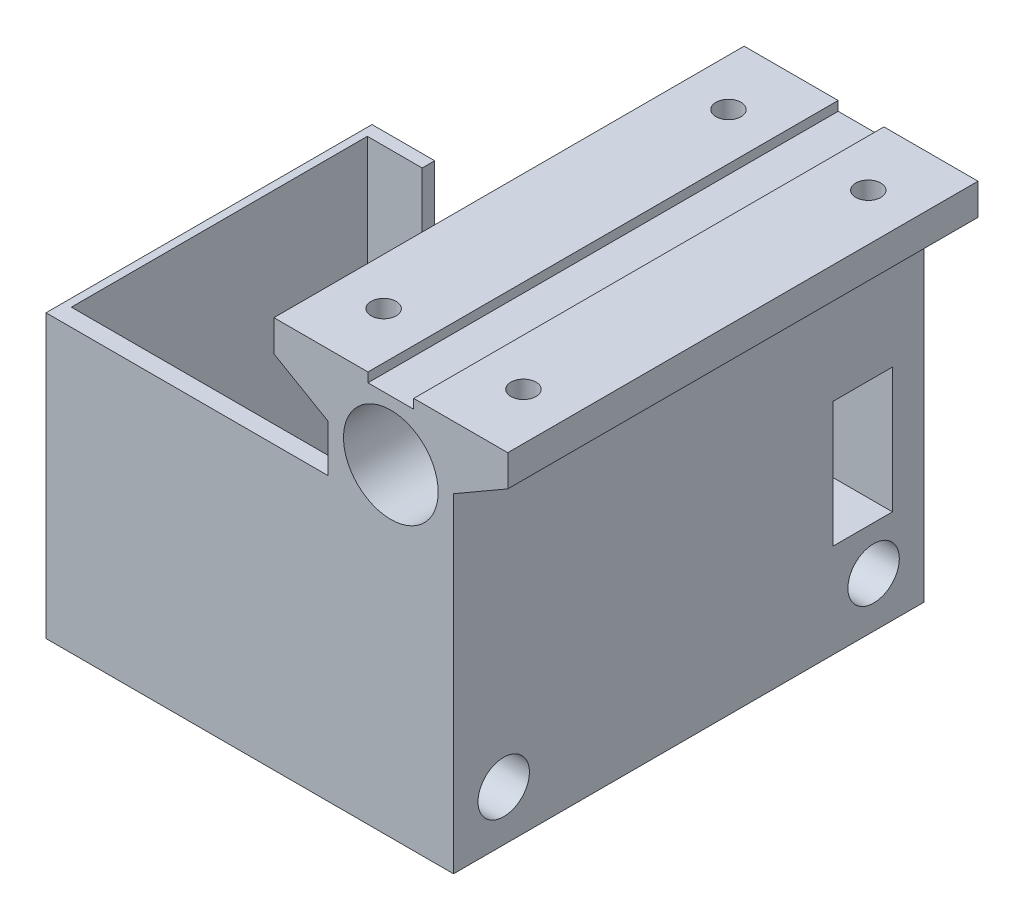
ISO-10303-21;
HEADER;
FILE_DESCRIPTION(('STEP AP214'),'2;1');
FILE_NAME('part.step','',(''),(''),'','','');
FILE_SCHEMA(('AUTOMOTIVE_DESIGN { 1 0 10303 214 1 1 1 1 }'));
ENDSEC;
DATA;
#1=APPLICATION_CONTEXT('core data for automotive mechanical design processes');
#2=APPLICATION_PROTOCOL_DEFINITION('international standard','automotive_design',2000,#1);
#3=PRODUCT_CONTEXT('',#1,'mechanical');
#4=PRODUCT('Part','Part','',(#3));
#5=PRODUCT_RELATED_PRODUCT_CATEGORY('part','',(#4));
#6=PRODUCT_DEFINITION_FORMATION('','',#4);
#7=PRODUCT_DEFINITION_CONTEXT('part definition',#1,'design');
#8=PRODUCT_DEFINITION('design','',#6,#7);
#9=PRODUCT_DEFINITION_SHAPE('','',#8);
#10=(LENGTH_UNIT() NAMED_UNIT(*) SI_UNIT(.MILLI.,.METRE.));
#11=(NAMED_UNIT(*) PLANE_ANGLE_UNIT() SI_UNIT($,.RADIAN.));
#12=(NAMED_UNIT(*) SI_UNIT($,.STERADIAN.) SOLID_ANGLE_UNIT());
#13=UNCERTAINTY_MEASURE_WITH_UNIT(LENGTH_MEASURE(1.E-05),#10,'distance_accuracy_value','');
#14=(GEOMETRIC_REPRESENTATION_CONTEXT(3) GLOBAL_UNCERTAINTY_ASSIGNED_CONTEXT((#13)) GLOBAL_UNIT_ASSIGNED_CONTEXT((#10,
#11,#12)) REPRESENTATION_CONTEXT('',''));
#15=CARTESIAN_POINT('',(0.,0.,0.));
#16=DIRECTION('',(0.,0.,1.));
#17=DIRECTION('',(1.,0.,0.));
#18=AXIS2_PLACEMENT_3D('',#15,#16,#17);
#19=CARTESIAN_POINT('',(-10.,1.00592017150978,75.));
#20=DIRECTION('',(1.,0.,0.));
#21=DIRECTION('',(0.,1.,0.));
#22=AXIS2_PLACEMENT_3D('',#19,#20,#21);
#23=PLANE('',#22);
#24=DIRECTION('',(0.,0.,1.));
#25=VECTOR('',#24,1.);
#26=CARTESIAN_POINT('',(-10.,-36.5,5.));
#27=LINE('',#26,#25);
#28=CARTESIAN_POINT('',(-10.,-36.5,5.));
#29=VERTEX_POINT('',#28);
#30=CARTESIAN_POINT('',(-10.,-36.5,14.5));
#31=VERTEX_POINT('',#30);
#32=EDGE_CURVE('E230',#29,#31,#27,.T.);
#33=ORIENTED_EDGE('',*,*,#32,.F.);
#34=DIRECTION('',(0.,-1.,0.));
#35=VECTOR('',#34,1.);
#36=CARTESIAN_POINT('',(-10.,-16.5,5.));
#37=LINE('',#36,#35);
#38=CARTESIAN_POINT('',(-10.,-16.5,5.));
#39=VERTEX_POINT('',#38);
#40=EDGE_CURVE('E54',#39,#29,#37,.T.);
#41=ORIENTED_EDGE('',*,*,#40,.F.);
#42=DIRECTION('',(0.,0.,1.));
#43=VECTOR('',#42,1.);
#44=CARTESIAN_POINT('',(-10.,-16.5,5.));
#45=LINE('',#44,#43);
#46=CARTESIAN_POINT('',(-10.,-16.5,14.5));
#47=VERTEX_POINT('',#46);
#48=EDGE_CURVE('E236',#39,#47,#45,.T.);
#49=ORIENTED_EDGE('',*,*,#48,.T.);
#50=DIRECTION('',(0.,-1.,0.));
#51=VECTOR('',#50,1.);
#52=CARTESIAN_POINT('',(-10.,-16.5,14.5));
#53=LINE('',#52,#51);
#54=EDGE_CURVE('E221',#47,#31,#53,.T.);
#55=ORIENTED_EDGE('',*,*,#54,.T.);
#56=EDGE_LOOP('',(#33,#41,#49,#55));
#57=FACE_BOUND('',#56,.T.);
#58=DIRECTION('',(0.,0.,-1.));
#59=VECTOR('',#58,1.);
#60=CARTESIAN_POINT('',(-10.,-6.50000000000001,75.));
#61=LINE('',#60,#59);
#62=CARTESIAN_POINT('',(-10.,-6.50000000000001,75.));
#63=VERTEX_POINT('',#62);
#64=CARTESIAN_POINT('',(-10.,-6.50000000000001,23.));
#65=VERTEX_POINT('',#64);
#66=EDGE_CURVE('E304',#63,#65,#61,.T.);
#67=ORIENTED_EDGE('',*,*,#66,.F.);
#68=DIRECTION('',(0.,-1.,0.));
#69=VECTOR('',#68,1.);
#70=CARTESIAN_POINT('',(-10.,1.00592017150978,75.));
#71=LINE('',#70,#69);
#72=CARTESIAN_POINT('',(-10.,1.00592017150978,75.));
#73=VERTEX_POINT('',#72);
#74=EDGE_CURVE('E355',#73,#63,#71,.T.);
#75=ORIENTED_EDGE('',*,*,#74,.F.);
#76=DIRECTION('',(0.,0.,-1.));
#77=VECTOR('',#76,1.);
#78=CARTESIAN_POINT('',(-10.,1.00592017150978,75.));
#79=LINE('',#78,#77);
#80=CARTESIAN_POINT('',(-10.,1.00592017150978,0.));
#81=VERTEX_POINT('',#80);
#82=EDGE_CURVE('E424',#73,#81,#79,.T.);
#83=ORIENTED_EDGE('',*,*,#82,.T.);
#84=DIRECTION('',(0.,-1.,0.));
#85=VECTOR('',#84,1.);
#86=CARTESIAN_POINT('',(-10.,1.00592017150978,0.));
#87=LINE('',#86,#85);
#88=CARTESIAN_POINT('',(-10.,-51.5,0.));
#89=VERTEX_POINT('',#88);
#90=EDGE_CURVE('E381',#81,#89,#87,.T.);
#91=ORIENTED_EDGE('',*,*,#90,.T.);
#92=DIRECTION('',(0.,0.,-1.));
#93=VECTOR('',#92,1.);
#94=CARTESIAN_POINT('',(-10.,-51.5,75.));
#95=LINE('',#94,#93);
#96=CARTESIAN_POINT('',(-10.,-51.5,23.));
#97=VERTEX_POINT('',#96);
#98=EDGE_CURVE('E422',#97,#89,#95,.T.);
#99=ORIENTED_EDGE('',*,*,#98,.F.);
#100=DIRECTION('',(0.,-1.,0.));
#101=VECTOR('',#100,1.);
#102=CARTESIAN_POINT('',(-10.,-6.50000000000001,23.));
#103=LINE('',#102,#101);
#104=EDGE_CURVE('E309',#65,#97,#103,.T.);
#105=ORIENTED_EDGE('',*,*,#104,.F.);
#106=EDGE_LOOP('',(#67,#75,#83,#91,#99,#105));
#107=FACE_BOUND('',#106,.T.);
#108=ADVANCED_FACE('F39',(#57,#107),#23,.F.);
#109=CARTESIAN_POINT('',(0.,0.,75.));
#110=DIRECTION('',(0.,0.,1.));
#111=DIRECTION('',(1.,0.,0.));
#112=AXIS2_PLACEMENT_3D('',#109,#110,#111);
#113=PLANE('',#112);
#114=DIRECTION('',(-1.,0.,0.));
#115=VECTOR('',#114,1.);
#116=CARTESIAN_POINT('',(-3.65,11.,75.));
#117=LINE('',#116,#115);
#118=CARTESIAN_POINT('',(-3.65,11.,75.));
#119=VERTEX_POINT('',#118);
#120=CARTESIAN_POINT('',(-18.65,11.,75.));
#121=VERTEX_POINT('',#120);
#122=EDGE_CURVE('E347',#119,#121,#117,.T.);
#123=ORIENTED_EDGE('',*,*,#122,.T.);
#124=DIRECTION('',(0.,-1.,0.));
#125=VECTOR('',#124,1.);
#126=CARTESIAN_POINT('',(-18.65,11.,75.));
#127=LINE('',#126,#125);
#128=CARTESIAN_POINT('',(-18.65,6.,75.));
#129=VERTEX_POINT('',#128);
#130=EDGE_CURVE('E350',#121,#129,#127,.T.);
#131=ORIENTED_EDGE('',*,*,#130,.T.);
#132=DIRECTION('',(0.86602540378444,-0.499999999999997,0.));
#133=VECTOR('',#132,1.);
#134=CARTESIAN_POINT('',(-18.65,6.,75.));
#135=LINE('',#134,#133);
#136=EDGE_CURVE('E353',#129,#73,#135,.T.);
#137=ORIENTED_EDGE('',*,*,#136,.T.);
#138=ORIENTED_EDGE('',*,*,#74,.T.);
#139=DIRECTION('',(1.,0.,0.));
#140=VECTOR('',#139,1.);
#141=CARTESIAN_POINT('',(-55.,-6.50000000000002,75.));
#142=LINE('',#141,#140);
#143=CARTESIAN_POINT('',(-55.,-6.50000000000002,75.));
#144=VERTEX_POINT('',#143);
#145=EDGE_CURVE('E326',#144,#63,#142,.T.);
#146=ORIENTED_EDGE('',*,*,#145,.F.);
#147=DIRECTION('',(0.,1.,0.));
#148=VECTOR('',#147,1.);
#149=CARTESIAN_POINT('',(-55.,-6.50000000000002,75.));
#150=LINE('',#149,#148);
#151=CARTESIAN_POINT('',(-55.,-51.5,75.));
#152=VERTEX_POINT('',#151);
#153=EDGE_CURVE('E305',#152,#144,#150,.T.);
#154=ORIENTED_EDGE('',*,*,#153,.F.);
#155=DIRECTION('',(1.,0.,0.));
#156=VECTOR('',#155,1.);
#157=CARTESIAN_POINT('',(-10.,-51.5,75.));
#158=LINE('',#157,#156);
#159=CARTESIAN_POINT('',(10.,-51.5,75.));
#160=VERTEX_POINT('',#159);
#161=EDGE_CURVE('E358',#152,#160,#158,.T.);
#162=ORIENTED_EDGE('',*,*,#161,.T.);
#163=DIRECTION('',(0.,1.,0.));
#164=VECTOR('',#163,1.);
#165=CARTESIAN_POINT('',(10.,1.00592017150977,75.));
#166=LINE('',#165,#164);
#167=CARTESIAN_POINT('',(10.,1.00592017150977,75.));
#168=VERTEX_POINT('',#167);
#169=EDGE_CURVE('E360',#160,#168,#166,.T.);
#170=ORIENTED_EDGE('',*,*,#169,.T.);
#171=DIRECTION('',(0.86602540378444,0.499999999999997,0.));
#172=VECTOR('',#171,1.);
#173=CARTESIAN_POINT('',(18.65,5.99999999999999,75.));
#174=LINE('',#173,#172);
#175=CARTESIAN_POINT('',(18.65,5.99999999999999,75.));
#176=VERTEX_POINT('',#175);
#177=EDGE_CURVE('E362',#168,#176,#174,.T.);
#178=ORIENTED_EDGE('',*,*,#177,.T.);
#179=DIRECTION('',(0.,1.,0.));
#180=VECTOR('',#179,1.);
#181=CARTESIAN_POINT('',(18.65,11.,75.));
#182=LINE('',#181,#180);
#183=CARTESIAN_POINT('',(18.65,11.,75.));
#184=VERTEX_POINT('',#183);
#185=EDGE_CURVE('E364',#176,#184,#182,.T.);
#186=ORIENTED_EDGE('',*,*,#185,.T.);
#187=DIRECTION('',(-1.,0.,0.));
#188=VECTOR('',#187,1.);
#189=CARTESIAN_POINT('',(3.65,11.,75.));
#190=LINE('',#189,#188);
#191=CARTESIAN_POINT('',(3.65,11.,75.));
#192=VERTEX_POINT('',#191);
#193=EDGE_CURVE('E366',#184,#192,#190,.T.);
#194=ORIENTED_EDGE('',*,*,#193,.T.);
#195=DIRECTION('',(0.,-1.,0.));
#196=VECTOR('',#195,1.);
#197=CARTESIAN_POINT('',(3.65,9.5,75.));
#198=LINE('',#197,#196);
#199=CARTESIAN_POINT('',(3.65,9.5,75.));
#200=VERTEX_POINT('',#199);
#201=EDGE_CURVE('E368',#192,#200,#198,.T.);
#202=ORIENTED_EDGE('',*,*,#201,.T.);
#203=DIRECTION('',(-1.,0.,0.));
#204=VECTOR('',#203,1.);
#205=CARTESIAN_POINT('',(-3.65,9.5,75.));
#206=LINE('',#205,#204);
#207=CARTESIAN_POINT('',(-3.65,9.5,75.));
#208=VERTEX_POINT('',#207);
#209=EDGE_CURVE('E370',#200,#208,#206,.T.);
#210=ORIENTED_EDGE('',*,*,#209,.T.);
#211=DIRECTION('',(0.,1.,0.));
#212=VECTOR('',#211,1.);
#213=CARTESIAN_POINT('',(-3.65,11.,75.));
#214=LINE('',#213,#212);
#215=EDGE_CURVE('E372',#208,#119,#214,.T.);
#216=ORIENTED_EDGE('',*,*,#215,.T.);
#217=EDGE_LOOP('',(#123,#131,#137,#138,#146,#154,#162,#170,#178,#186,#194,#202,#210,#216));
#218=FACE_BOUND('',#217,.T.);
#219=CARTESIAN_POINT('',(0.,0.,75.));
#220=DIRECTION('',(0.,0.,1.));
#221=DIRECTION('',(1.,0.,0.));
#222=AXIS2_PLACEMENT_3D('',#219,#220,#221);
#223=CIRCLE('',#222,7.55);
#224=CARTESIAN_POINT('',(7.55,0.,75.));
#225=VERTEX_POINT('',#224);
#226=EDGE_CURVE('E341',#225,#225,#223,.T.);
#227=ORIENTED_EDGE('',*,*,#226,.F.);
#228=EDGE_LOOP('',(#227));
#229=FACE_BOUND('',#228,.T.);
#230=ADVANCED_FACE('F490',(#218,#229),#113,.T.);
#231=CARTESIAN_POINT('',(0.,0.,0.));
#232=DIRECTION('',(0.,0.,1.));
#233=DIRECTION('',(1.,0.,0.));
#234=AXIS2_PLACEMENT_3D('',#231,#232,#233);
#235=PLANE('',#234);
#236=DIRECTION('',(-1.,0.,0.));
#237=VECTOR('',#236,1.);
#238=CARTESIAN_POINT('',(-3.65,11.,0.));
#239=LINE('',#238,#237);
#240=CARTESIAN_POINT('',(-3.65,11.,0.));
#241=VERTEX_POINT('',#240);
#242=CARTESIAN_POINT('',(-18.65,11.,0.));
#243=VERTEX_POINT('',#242);
#244=EDGE_CURVE('E344',#241,#243,#239,.T.);
#245=ORIENTED_EDGE('',*,*,#244,.F.);
#246=DIRECTION('',(0.,1.,0.));
#247=VECTOR('',#246,1.);
#248=CARTESIAN_POINT('',(-3.65,11.,0.));
#249=LINE('',#248,#247);
#250=CARTESIAN_POINT('',(-3.65,9.5,0.));
#251=VERTEX_POINT('',#250);
#252=EDGE_CURVE('E351',#251,#241,#249,.T.);
#253=ORIENTED_EDGE('',*,*,#252,.F.);
#254=DIRECTION('',(-1.,0.,0.));
#255=VECTOR('',#254,1.);
#256=CARTESIAN_POINT('',(-3.65,9.5,0.));
#257=LINE('',#256,#255);
#258=CARTESIAN_POINT('',(3.65,9.5,0.));
#259=VERTEX_POINT('',#258);
#260=EDGE_CURVE('E396',#259,#251,#257,.T.);
#261=ORIENTED_EDGE('',*,*,#260,.F.);
#262=DIRECTION('',(0.,-1.,0.));
#263=VECTOR('',#262,1.);
#264=CARTESIAN_POINT('',(3.65,9.5,0.));
#265=LINE('',#264,#263);
#266=CARTESIAN_POINT('',(3.65,11.,0.));
#267=VERTEX_POINT('',#266);
#268=EDGE_CURVE('E394',#267,#259,#265,.T.);
#269=ORIENTED_EDGE('',*,*,#268,.F.);
#270=DIRECTION('',(-1.,0.,0.));
#271=VECTOR('',#270,1.);
#272=CARTESIAN_POINT('',(3.65,11.,0.));
#273=LINE('',#272,#271);
#274=CARTESIAN_POINT('',(18.65,11.,0.));
#275=VERTEX_POINT('',#274);
#276=EDGE_CURVE('E392',#275,#267,#273,.T.);
#277=ORIENTED_EDGE('',*,*,#276,.F.);
#278=DIRECTION('',(0.,1.,0.));
#279=VECTOR('',#278,1.);
#280=CARTESIAN_POINT('',(18.65,11.,0.));
#281=LINE('',#280,#279);
#282=CARTESIAN_POINT('',(18.65,5.99999999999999,0.));
#283=VERTEX_POINT('',#282);
#284=EDGE_CURVE('E390',#283,#275,#281,.T.);
#285=ORIENTED_EDGE('',*,*,#284,.F.);
#286=DIRECTION('',(0.86602540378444,0.499999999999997,0.));
#287=VECTOR('',#286,1.);
#288=CARTESIAN_POINT('',(18.65,5.99999999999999,0.));
#289=LINE('',#288,#287);
#290=CARTESIAN_POINT('',(10.,1.00592017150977,0.));
#291=VERTEX_POINT('',#290);
#292=EDGE_CURVE('E388',#291,#283,#289,.T.);
#293=ORIENTED_EDGE('',*,*,#292,.F.);
#294=DIRECTION('',(0.,1.,0.));
#295=VECTOR('',#294,1.);
#296=CARTESIAN_POINT('',(10.,1.00592017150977,0.));
#297=LINE('',#296,#295);
#298=CARTESIAN_POINT('',(10.,-51.5,0.));
#299=VERTEX_POINT('',#298);
#300=EDGE_CURVE('E386',#299,#291,#297,.T.);
#301=ORIENTED_EDGE('',*,*,#300,.F.);
#302=DIRECTION('',(1.,0.,0.));
#303=VECTOR('',#302,1.);
#304=CARTESIAN_POINT('',(-10.,-51.5,0.));
#305=LINE('',#304,#303);
#306=EDGE_CURVE('E384',#89,#299,#305,.T.);
#307=ORIENTED_EDGE('',*,*,#306,.F.);
#308=ORIENTED_EDGE('',*,*,#90,.F.);
#309=DIRECTION('',(0.86602540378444,-0.499999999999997,0.));
#310=VECTOR('',#309,1.);
#311=CARTESIAN_POINT('',(-18.65,6.,0.));
#312=LINE('',#311,#310);
#313=CARTESIAN_POINT('',(-18.65,6.,0.));
#314=VERTEX_POINT('',#313);
#315=EDGE_CURVE('E379',#314,#81,#312,.T.);
#316=ORIENTED_EDGE('',*,*,#315,.F.);
#317=DIRECTION('',(0.,-1.,0.));
#318=VECTOR('',#317,1.);
#319=CARTESIAN_POINT('',(-18.65,11.,0.));
#320=LINE('',#319,#318);
#321=EDGE_CURVE('E377',#243,#314,#320,.T.);
#322=ORIENTED_EDGE('',*,*,#321,.F.);
#323=EDGE_LOOP('',(#245,#253,#261,#269,#277,#285,#293,#301,#307,#308,#316,#322));
#324=FACE_BOUND('',#323,.T.);
#325=CARTESIAN_POINT('',(0.,0.,0.));
#326=DIRECTION('',(0.,0.,1.));
#327=DIRECTION('',(1.,0.,0.));
#328=AXIS2_PLACEMENT_3D('',#325,#326,#327);
#329=CIRCLE('',#328,7.55);
#330=CARTESIAN_POINT('',(7.55,0.,0.));
#331=VERTEX_POINT('',#330);
#332=EDGE_CURVE('E332',#331,#331,#329,.T.);
#333=ORIENTED_EDGE('',*,*,#332,.T.);
#334=EDGE_LOOP('',(#333));
#335=FACE_BOUND('',#334,.T.);
#336=ADVANCED_FACE('F474',(#324,#335),#235,.F.);
#337=CARTESIAN_POINT('',(-3.65,11.,75.));
#338=DIRECTION('',(0.,-1.,0.));
#339=DIRECTION('',(1.,0.,0.));
#340=AXIS2_PLACEMENT_3D('',#337,#338,#339);
#341=PLANE('',#340);
#342=CARTESIAN_POINT('',(-11.15,11.,65.));
#343=DIRECTION('',(0.,1.,0.));
#344=DIRECTION('',(-1.,0.,0.));
#345=AXIS2_PLACEMENT_3D('',#342,#343,#344);
#346=CIRCLE('',#345,2.);
#347=CARTESIAN_POINT('',(-13.15,11.,65.));
#348=VERTEX_POINT('',#347);
#349=EDGE_CURVE('E460',#348,#348,#346,.T.);
#350=ORIENTED_EDGE('',*,*,#349,.F.);
#351=EDGE_LOOP('',(#350));
#352=FACE_BOUND('',#351,.T.);
#353=CARTESIAN_POINT('',(-11.15,11.,10.));
#354=DIRECTION('',(0.,1.,0.));
#355=DIRECTION('',(-1.,0.,0.));
#356=AXIS2_PLACEMENT_3D('',#353,#354,#355);
#357=CIRCLE('',#356,2.);
#358=CARTESIAN_POINT('',(-13.15,11.,10.));
#359=VERTEX_POINT('',#358);
#360=EDGE_CURVE('E449',#359,#359,#357,.T.);
#361=ORIENTED_EDGE('',*,*,#360,.F.);
#362=EDGE_LOOP('',(#361));
#363=FACE_BOUND('',#362,.T.);
#364=ORIENTED_EDGE('',*,*,#244,.T.);
#365=DIRECTION('',(0.,0.,-1.));
#366=VECTOR('',#365,1.);
#367=CARTESIAN_POINT('',(-18.65,11.,75.));
#368=LINE('',#367,#366);
#369=EDGE_CURVE('E430',#121,#243,#368,.T.);
#370=ORIENTED_EDGE('',*,*,#369,.F.);
#371=ORIENTED_EDGE('',*,*,#122,.F.);
#372=DIRECTION('',(0.,0.,-1.));
#373=VECTOR('',#372,1.);
#374=CARTESIAN_POINT('',(-3.65,11.,75.));
#375=LINE('',#374,#373);
#376=EDGE_CURVE('E374',#119,#241,#375,.T.);
#377=ORIENTED_EDGE('',*,*,#376,.T.);
#378=EDGE_LOOP('',(#364,#370,#371,#377));
#379=FACE_BOUND('',#378,.T.);
#380=ADVANCED_FACE('F41',(#352,#363,#379),#341,.F.);
#381=CARTESIAN_POINT('',(-18.65,11.,75.));
#382=DIRECTION('',(1.,0.,0.));
#383=DIRECTION('',(0.,1.,0.));
#384=AXIS2_PLACEMENT_3D('',#381,#382,#383);
#385=PLANE('',#384);
#386=ORIENTED_EDGE('',*,*,#321,.T.);
#387=DIRECTION('',(0.,0.,-1.));
#388=VECTOR('',#387,1.);
#389=CARTESIAN_POINT('',(-18.65,6.,75.));
#390=LINE('',#389,#388);
#391=EDGE_CURVE('E427',#129,#314,#390,.T.);
#392=ORIENTED_EDGE('',*,*,#391,.F.);
#393=ORIENTED_EDGE('',*,*,#130,.F.);
#394=ORIENTED_EDGE('',*,*,#369,.T.);
#395=EDGE_LOOP('',(#386,#392,#393,#394));
#396=FACE_BOUND('',#395,.T.);
#397=ADVANCED_FACE('F473',(#396),#385,.F.);
#398=CARTESIAN_POINT('',(-18.65,6.,75.));
#399=DIRECTION('',(0.499999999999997,0.86602540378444,0.));
#400=DIRECTION('',(-0.86602540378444,0.499999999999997,0.));
#401=AXIS2_PLACEMENT_3D('',#398,#399,#400);
#402=PLANE('',#401);
#403=ORIENTED_EDGE('',*,*,#315,.T.);
#404=ORIENTED_EDGE('',*,*,#82,.F.);
#405=ORIENTED_EDGE('',*,*,#136,.F.);
#406=ORIENTED_EDGE('',*,*,#391,.T.);
#407=EDGE_LOOP('',(#403,#404,#405,#406));
#408=FACE_BOUND('',#407,.T.);
#409=ADVANCED_FACE('F534',(#408),#402,.F.);
#410=CARTESIAN_POINT('',(-10.,-51.5,75.));
#411=DIRECTION('',(0.,1.,0.));
#412=DIRECTION('',(0.,0.,1.));
#413=AXIS2_PLACEMENT_3D('',#410,#411,#412);
#414=PLANE('',#413);
#415=ORIENTED_EDGE('',*,*,#306,.T.);
#416=DIRECTION('',(0.,0.,-1.));
#417=VECTOR('',#416,1.);
#418=CARTESIAN_POINT('',(10.,-51.5,75.));
#419=LINE('',#418,#417);
#420=EDGE_CURVE('E419',#160,#299,#419,.T.);
#421=ORIENTED_EDGE('',*,*,#420,.F.);
#422=ORIENTED_EDGE('',*,*,#161,.F.);
#423=DIRECTION('',(0.,0.,1.));
#424=VECTOR('',#423,1.);
#425=CARTESIAN_POINT('',(-55.,-51.5,75.));
#426=LINE('',#425,#424);
#427=CARTESIAN_POINT('',(-55.,-51.5,23.));
#428=VERTEX_POINT('',#427);
#429=EDGE_CURVE('E313',#428,#152,#426,.T.);
#430=ORIENTED_EDGE('',*,*,#429,.F.);
#431=DIRECTION('',(1.,0.,0.));
#432=VECTOR('',#431,1.);
#433=CARTESIAN_POINT('',(-55.,-51.5,23.));
#434=LINE('',#433,#432);
#435=EDGE_CURVE('E316',#428,#97,#434,.T.);
#436=ORIENTED_EDGE('',*,*,#435,.T.);
#437=ORIENTED_EDGE('',*,*,#98,.T.);
#438=EDGE_LOOP('',(#415,#421,#422,#430,#436,#437));
#439=FACE_BOUND('',#438,.T.);
#440=ADVANCED_FACE('F526',(#439),#414,.F.);
#441=CARTESIAN_POINT('',(10.,1.00592017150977,75.));
#442=DIRECTION('',(-1.,0.,0.));
#443=DIRECTION('',(0.,-1.,0.));
#444=AXIS2_PLACEMENT_3D('',#441,#442,#443);
#445=PLANE('',#444);
#446=DIRECTION('',(0.,0.,1.));
#447=VECTOR('',#446,1.);
#448=CARTESIAN_POINT('',(10.,-16.5,75.));
#449=LINE('',#448,#447);
#450=CARTESIAN_POINT('',(10.,-16.5,5.));
#451=VERTEX_POINT('',#450);
#452=CARTESIAN_POINT('',(10.,-16.5,14.5));
#453=VERTEX_POINT('',#452);
#454=EDGE_CURVE('E47',#451,#453,#449,.T.);
#455=ORIENTED_EDGE('',*,*,#454,.F.);
#456=DIRECTION('',(0.,-1.,0.));
#457=VECTOR('',#456,1.);
#458=CARTESIAN_POINT('',(10.,1.00592017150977,5.));
#459=LINE('',#458,#457);
#460=CARTESIAN_POINT('',(10.,-36.5,5.));
#461=VERTEX_POINT('',#460);
#462=EDGE_CURVE('E12',#451,#461,#459,.T.);
#463=ORIENTED_EDGE('',*,*,#462,.T.);
#464=DIRECTION('',(0.,0.,1.));
#465=VECTOR('',#464,1.);
#466=CARTESIAN_POINT('',(10.,-36.5,75.));
#467=LINE('',#466,#465);
#468=CARTESIAN_POINT('',(10.,-36.5,14.5));
#469=VERTEX_POINT('',#468);
#470=EDGE_CURVE('E433',#461,#469,#467,.T.);
#471=ORIENTED_EDGE('',*,*,#470,.T.);
#472=DIRECTION('',(0.,-1.,0.));
#473=VECTOR('',#472,1.);
#474=CARTESIAN_POINT('',(10.,1.00592017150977,14.5));
#475=LINE('',#474,#473);
#476=EDGE_CURVE('E224',#453,#469,#475,.T.);
#477=ORIENTED_EDGE('',*,*,#476,.F.);
#478=EDGE_LOOP('',(#455,#463,#471,#477));
#479=FACE_BOUND('',#478,.T.);
#480=CARTESIAN_POINT('',(10.,-43.5,8.));
#481=DIRECTION('',(1.,0.,0.));
#482=DIRECTION('',(0.,1.,0.));
#483=AXIS2_PLACEMENT_3D('',#480,#481,#482);
#484=CIRCLE('',#483,4.1);
#485=CARTESIAN_POINT('',(10.,-39.4,8.));
#486=VERTEX_POINT('',#485);
#487=EDGE_CURVE('E333',#486,#486,#484,.T.);
#488=ORIENTED_EDGE('',*,*,#487,.F.);
#489=EDGE_LOOP('',(#488));
#490=FACE_BOUND('',#489,.T.);
#491=CARTESIAN_POINT('',(10.,-43.5,67.));
#492=DIRECTION('',(1.,0.,0.));
#493=DIRECTION('',(0.,1.,0.));
#494=AXIS2_PLACEMENT_3D('',#491,#492,#493);
#495=CIRCLE('',#494,4.1);
#496=CARTESIAN_POINT('',(10.,-39.4,67.));
#497=VERTEX_POINT('',#496);
#498=EDGE_CURVE('E328',#497,#497,#495,.T.);
#499=ORIENTED_EDGE('',*,*,#498,.F.);
#500=EDGE_LOOP('',(#499));
#501=FACE_BOUND('',#500,.T.);
#502=ORIENTED_EDGE('',*,*,#300,.T.);
#503=DIRECTION('',(0.,0.,-1.));
#504=VECTOR('',#503,1.);
#505=CARTESIAN_POINT('',(10.,1.00592017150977,75.));
#506=LINE('',#505,#504);
#507=EDGE_CURVE('E416',#168,#291,#506,.T.);
#508=ORIENTED_EDGE('',*,*,#507,.F.);
#509=ORIENTED_EDGE('',*,*,#169,.F.);
#510=ORIENTED_EDGE('',*,*,#420,.T.);
#511=EDGE_LOOP('',(#502,#508,#509,#510));
#512=FACE_BOUND('',#511,.T.);
#513=ADVANCED_FACE('F440',(#479,#490,#501,#512),#445,.F.);
#514=CARTESIAN_POINT('',(18.65,5.99999999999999,75.));
#515=DIRECTION('',(-0.499999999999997,0.86602540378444,0.));
#516=DIRECTION('',(-0.86602540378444,-0.499999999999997,0.));
#517=AXIS2_PLACEMENT_3D('',#514,#515,#516);
#518=PLANE('',#517);
#519=ORIENTED_EDGE('',*,*,#292,.T.);
#520=DIRECTION('',(0.,0.,-1.));
#521=VECTOR('',#520,1.);
#522=CARTESIAN_POINT('',(18.65,5.99999999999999,75.));
#523=LINE('',#522,#521);
#524=EDGE_CURVE('E413',#176,#283,#523,.T.);
#525=ORIENTED_EDGE('',*,*,#524,.F.);
#526=ORIENTED_EDGE('',*,*,#177,.F.);
#527=ORIENTED_EDGE('',*,*,#507,.T.);
#528=EDGE_LOOP('',(#519,#525,#526,#527));
#529=FACE_BOUND('',#528,.T.);
#530=ADVANCED_FACE('F519',(#529),#518,.F.);
#531=CARTESIAN_POINT('',(18.65,11.,75.));
#532=DIRECTION('',(-1.,0.,0.));
#533=DIRECTION('',(0.,-1.,0.));
#534=AXIS2_PLACEMENT_3D('',#531,#532,#533);
#535=PLANE('',#534);
#536=ORIENTED_EDGE('',*,*,#284,.T.);
#537=DIRECTION('',(0.,0.,-1.));
#538=VECTOR('',#537,1.);
#539=CARTESIAN_POINT('',(18.65,11.,75.));
#540=LINE('',#539,#538);
#541=EDGE_CURVE('E410',#184,#275,#540,.T.);
#542=ORIENTED_EDGE('',*,*,#541,.F.);
#543=ORIENTED_EDGE('',*,*,#185,.F.);
#544=ORIENTED_EDGE('',*,*,#524,.T.);
#545=EDGE_LOOP('',(#536,#542,#543,#544));
#546=FACE_BOUND('',#545,.T.);
#547=ADVANCED_FACE('F513',(#546),#535,.F.);
#548=CARTESIAN_POINT('',(3.65,11.,75.));
#549=DIRECTION('',(0.,-1.,0.));
#550=DIRECTION('',(1.,0.,0.));
#551=AXIS2_PLACEMENT_3D('',#548,#549,#550);
#552=PLANE('',#551);
#553=CARTESIAN_POINT('',(11.15,11.,65.));
#554=DIRECTION('',(0.,1.,0.));
#555=DIRECTION('',(-1.,0.,0.));
#556=AXIS2_PLACEMENT_3D('',#553,#554,#555);
#557=CIRCLE('',#556,2.);
#558=CARTESIAN_POINT('',(9.15000000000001,11.,65.));
#559=VERTEX_POINT('',#558);
#560=EDGE_CURVE('E454',#559,#559,#557,.T.);
#561=ORIENTED_EDGE('',*,*,#560,.F.);
#562=EDGE_LOOP('',(#561));
#563=FACE_BOUND('',#562,.T.);
#564=CARTESIAN_POINT('',(11.15,11.,10.));
#565=DIRECTION('',(0.,1.,0.));
#566=DIRECTION('',(-1.,0.,0.));
#567=AXIS2_PLACEMENT_3D('',#564,#565,#566);
#568=CIRCLE('',#567,2.);
#569=CARTESIAN_POINT('',(9.15,11.,10.));
#570=VERTEX_POINT('',#569);
#571=EDGE_CURVE('E445',#570,#570,#568,.T.);
#572=ORIENTED_EDGE('',*,*,#571,.F.);
#573=EDGE_LOOP('',(#572));
#574=FACE_BOUND('',#573,.T.);
#575=ORIENTED_EDGE('',*,*,#276,.T.);
#576=DIRECTION('',(0.,0.,-1.));
#577=VECTOR('',#576,1.);
#578=CARTESIAN_POINT('',(3.65,11.,75.));
#579=LINE('',#578,#577);
#580=EDGE_CURVE('E407',#192,#267,#579,.T.);
#581=ORIENTED_EDGE('',*,*,#580,.F.);
#582=ORIENTED_EDGE('',*,*,#193,.F.);
#583=ORIENTED_EDGE('',*,*,#541,.T.);
#584=EDGE_LOOP('',(#575,#581,#582,#583));
#585=FACE_BOUND('',#584,.T.);
#586=ADVANCED_FACE('F509',(#563,#574,#585),#552,.F.);
#587=CARTESIAN_POINT('',(3.65,9.5,75.));
#588=DIRECTION('',(1.,0.,0.));
#589=DIRECTION('',(0.,1.,0.));
#590=AXIS2_PLACEMENT_3D('',#587,#588,#589);
#591=PLANE('',#590);
#592=ORIENTED_EDGE('',*,*,#268,.T.);
#593=DIRECTION('',(0.,0.,-1.));
#594=VECTOR('',#593,1.);
#595=CARTESIAN_POINT('',(3.65,9.5,75.));
#596=LINE('',#595,#594);
#597=EDGE_CURVE('E404',#200,#259,#596,.T.);
#598=ORIENTED_EDGE('',*,*,#597,.F.);
#599=ORIENTED_EDGE('',*,*,#201,.F.);
#600=ORIENTED_EDGE('',*,*,#580,.T.);
#601=EDGE_LOOP('',(#592,#598,#599,#600));
#602=FACE_BOUND('',#601,.T.);
#603=ADVANCED_FACE('F504',(#602),#591,.F.);
#604=CARTESIAN_POINT('',(-3.65,9.5,75.));
#605=DIRECTION('',(0.,-1.,0.));
#606=DIRECTION('',(1.,0.,0.));
#607=AXIS2_PLACEMENT_3D('',#604,#605,#606);
#608=PLANE('',#607);
#609=ORIENTED_EDGE('',*,*,#260,.T.);
#610=DIRECTION('',(0.,0.,-1.));
#611=VECTOR('',#610,1.);
#612=CARTESIAN_POINT('',(-3.65,9.5,75.));
#613=LINE('',#612,#611);
#614=EDGE_CURVE('E401',#208,#251,#613,.T.);
#615=ORIENTED_EDGE('',*,*,#614,.F.);
#616=ORIENTED_EDGE('',*,*,#209,.F.);
#617=ORIENTED_EDGE('',*,*,#597,.T.);
#618=EDGE_LOOP('',(#609,#615,#616,#617));
#619=FACE_BOUND('',#618,.T.);
#620=ADVANCED_FACE('F498',(#619),#608,.F.);
#621=CARTESIAN_POINT('',(-3.65,11.,75.));
#622=DIRECTION('',(-1.,0.,0.));
#623=DIRECTION('',(0.,-1.,0.));
#624=AXIS2_PLACEMENT_3D('',#621,#622,#623);
#625=PLANE('',#624);
#626=ORIENTED_EDGE('',*,*,#252,.T.);
#627=ORIENTED_EDGE('',*,*,#376,.F.);
#628=ORIENTED_EDGE('',*,*,#215,.F.);
#629=ORIENTED_EDGE('',*,*,#614,.T.);
#630=EDGE_LOOP('',(#626,#627,#628,#629));
#631=FACE_BOUND('',#630,.T.);
#632=ADVANCED_FACE('F496',(#631),#625,.F.);
#633=CARTESIAN_POINT('',(0.,0.,75.));
#634=DIRECTION('',(0.,0.,-1.));
#635=DIRECTION('',(-1.,0.,0.));
#636=AXIS2_PLACEMENT_3D('',#633,#634,#635);
#637=CYLINDRICAL_SURFACE('',#636,7.55);
#638=ORIENTED_EDGE('',*,*,#226,.T.);
#639=EDGE_LOOP('',(#638));
#640=FACE_BOUND('',#639,.T.);
#641=ORIENTED_EDGE('',*,*,#332,.F.);
#642=EDGE_LOOP('',(#641));
#643=FACE_BOUND('',#642,.T.);
#644=ADVANCED_FACE('F655',(#640,#643),#637,.F.);
#645=CARTESIAN_POINT('',(0.,-43.5,67.));
#646=DIRECTION('',(1.,0.,0.));
#647=DIRECTION('',(0.,1.,0.));
#648=AXIS2_PLACEMENT_3D('',#645,#646,#647);
#649=CYLINDRICAL_SURFACE('',#648,4.1);
#650=CARTESIAN_POINT('',(0.,-43.5,67.));
#651=DIRECTION('',(1.,0.,0.));
#652=DIRECTION('',(0.,1.,0.));
#653=AXIS2_PLACEMENT_3D('',#650,#651,#652);
#654=CIRCLE('',#653,4.1);
#655=CARTESIAN_POINT('',(0.,-39.4,67.));
#656=VERTEX_POINT('',#655);
#657=EDGE_CURVE('E336',#656,#656,#654,.T.);
#658=ORIENTED_EDGE('',*,*,#657,.F.);
#659=EDGE_LOOP('',(#658));
#660=FACE_BOUND('',#659,.T.);
#661=ORIENTED_EDGE('',*,*,#498,.T.);
#662=EDGE_LOOP('',(#661));
#663=FACE_BOUND('',#662,.T.);
#664=ADVANCED_FACE('F662',(#660,#663),#649,.F.);
#665=CARTESIAN_POINT('',(0.,0.,0.));
#666=DIRECTION('',(1.,0.,0.));
#667=DIRECTION('',(0.,1.,0.));
#668=AXIS2_PLACEMENT_3D('',#665,#666,#667);
#669=PLANE('',#668);
#670=ORIENTED_EDGE('',*,*,#657,.T.);
#671=EDGE_LOOP('',(#670));
#672=FACE_BOUND('',#671,.T.);
#673=ADVANCED_FACE('F670',(#672),#669,.T.);
#674=CARTESIAN_POINT('',(0.,-43.5,8.));
#675=DIRECTION('',(1.,0.,0.));
#676=DIRECTION('',(0.,1.,0.));
#677=AXIS2_PLACEMENT_3D('',#674,#675,#676);
#678=CYLINDRICAL_SURFACE('',#677,4.1);
#679=CARTESIAN_POINT('',(0.,-43.5,8.));
#680=DIRECTION('',(1.,0.,0.));
#681=DIRECTION('',(0.,1.,0.));
#682=AXIS2_PLACEMENT_3D('',#679,#680,#681);
#683=CIRCLE('',#682,4.1);
#684=CARTESIAN_POINT('',(0.,-39.4,8.));
#685=VERTEX_POINT('',#684);
#686=EDGE_CURVE('E329',#685,#685,#683,.T.);
#687=ORIENTED_EDGE('',*,*,#686,.F.);
#688=EDGE_LOOP('',(#687));
#689=FACE_BOUND('',#688,.T.);
#690=ORIENTED_EDGE('',*,*,#487,.T.);
#691=EDGE_LOOP('',(#690));
#692=FACE_BOUND('',#691,.T.);
#693=ADVANCED_FACE('F678',(#689,#692),#678,.F.);
#694=CARTESIAN_POINT('',(0.,0.,0.));
#695=DIRECTION('',(1.,0.,0.));
#696=DIRECTION('',(0.,1.,0.));
#697=AXIS2_PLACEMENT_3D('',#694,#695,#696);
#698=PLANE('',#697);
#699=ORIENTED_EDGE('',*,*,#686,.T.);
#700=EDGE_LOOP('',(#699));
#701=FACE_BOUND('',#700,.T.);
#702=ADVANCED_FACE('F686',(#701),#698,.T.);
#703=CARTESIAN_POINT('',(-55.,-6.50000000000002,75.));
#704=DIRECTION('',(0.,-1.,0.));
#705=DIRECTION('',(1.,0.,0.));
#706=AXIS2_PLACEMENT_3D('',#703,#704,#705);
#707=PLANE('',#706);
#708=DIRECTION('',(1.,0.,0.));
#709=VECTOR('',#708,1.);
#710=CARTESIAN_POINT('',(-53.75,-6.50000000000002,25.));
#711=LINE('',#710,#709);
#712=CARTESIAN_POINT('',(-53.75,-6.50000000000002,25.));
#713=VERTEX_POINT('',#712);
#714=CARTESIAN_POINT('',(-45.,-6.50000000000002,25.));
#715=VERTEX_POINT('',#714);
#716=EDGE_CURVE('E284',#713,#715,#711,.T.);
#717=ORIENTED_EDGE('',*,*,#716,.T.);
#718=DIRECTION('',(0.,0.,1.));
#719=VECTOR('',#718,1.);
#720=CARTESIAN_POINT('',(-45.,-6.50000000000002,23.));
#721=LINE('',#720,#719);
#722=CARTESIAN_POINT('',(-45.,-6.50000000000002,23.));
#723=VERTEX_POINT('',#722);
#724=EDGE_CURVE('E281',#723,#715,#721,.T.);
#725=ORIENTED_EDGE('',*,*,#724,.F.);
#726=DIRECTION('',(1.,0.,0.));
#727=VECTOR('',#726,1.);
#728=CARTESIAN_POINT('',(-55.,-6.50000000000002,23.));
#729=LINE('',#728,#727);
#730=CARTESIAN_POINT('',(-55.,-6.50000000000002,23.));
#731=VERTEX_POINT('',#730);
#732=EDGE_CURVE('E323',#731,#723,#729,.T.);
#733=ORIENTED_EDGE('',*,*,#732,.F.);
#734=DIRECTION('',(0.,0.,-1.));
#735=VECTOR('',#734,1.);
#736=CARTESIAN_POINT('',(-55.,-6.50000000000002,75.));
#737=LINE('',#736,#735);
#738=EDGE_CURVE('E308',#144,#731,#737,.T.);
#739=ORIENTED_EDGE('',*,*,#738,.F.);
#740=ORIENTED_EDGE('',*,*,#145,.T.);
#741=ORIENTED_EDGE('',*,*,#66,.T.);
#742=CARTESIAN_POINT('',(-20.,-6.50000000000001,23.));
#743=VERTEX_POINT('',#742);
#744=EDGE_CURVE('E322',#743,#65,#729,.T.);
#745=ORIENTED_EDGE('',*,*,#744,.F.);
#746=DIRECTION('',(0.,0.,1.));
#747=VECTOR('',#746,1.);
#748=CARTESIAN_POINT('',(-20.,-6.50000000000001,23.));
#749=LINE('',#748,#747);
#750=CARTESIAN_POINT('',(-20.,-6.50000000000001,25.));
#751=VERTEX_POINT('',#750);
#752=EDGE_CURVE('E278',#743,#751,#749,.T.);
#753=ORIENTED_EDGE('',*,*,#752,.T.);
#754=DIRECTION('',(1.,0.,0.));
#755=VECTOR('',#754,1.);
#756=CARTESIAN_POINT('',(-20.,-6.50000000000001,25.));
#757=LINE('',#756,#755);
#758=CARTESIAN_POINT('',(-11.25,-6.50000000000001,25.));
#759=VERTEX_POINT('',#758);
#760=EDGE_CURVE('E275',#751,#759,#757,.T.);
#761=ORIENTED_EDGE('',*,*,#760,.T.);
#762=DIRECTION('',(0.,0.,1.));
#763=VECTOR('',#762,1.);
#764=CARTESIAN_POINT('',(-11.25,-6.50000000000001,25.));
#765=LINE('',#764,#763);
#766=CARTESIAN_POINT('',(-11.25,-6.50000000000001,72.2));
#767=VERTEX_POINT('',#766);
#768=EDGE_CURVE('E272',#759,#767,#765,.T.);
#769=ORIENTED_EDGE('',*,*,#768,.T.);
#770=DIRECTION('',(1.,0.,0.));
#771=VECTOR('',#770,1.);
#772=CARTESIAN_POINT('',(-53.75,-6.50000000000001,72.2));
#773=LINE('',#772,#771);
#774=CARTESIAN_POINT('',(-53.75,-6.50000000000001,72.2));
#775=VERTEX_POINT('',#774);
#776=EDGE_CURVE('E269',#775,#767,#773,.T.);
#777=ORIENTED_EDGE('',*,*,#776,.F.);
#778=DIRECTION('',(0.,0.,1.));
#779=VECTOR('',#778,1.);
#780=CARTESIAN_POINT('',(-53.75,-6.50000000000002,25.));
#781=LINE('',#780,#779);
#782=EDGE_CURVE('E243',#713,#775,#781,.T.);
#783=ORIENTED_EDGE('',*,*,#782,.F.);
#784=EDGE_LOOP('',(#717,#725,#733,#739,#740,#741,#745,#753,#761,#769,#777,#783));
#785=FACE_BOUND('',#784,.T.);
#786=ADVANCED_FACE('F538',(#785),#707,.F.);
#787=CARTESIAN_POINT('',(-55.,-6.50000000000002,23.));
#788=DIRECTION('',(0.,0.,1.));
#789=DIRECTION('',(0.,-1.,0.));
#790=AXIS2_PLACEMENT_3D('',#787,#788,#789);
#791=PLANE('',#790);
#792=ORIENTED_EDGE('',*,*,#732,.T.);
#793=DIRECTION('',(0.,1.,0.));
#794=VECTOR('',#793,1.);
#795=CARTESIAN_POINT('',(-45.,-116.514536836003,23.));
#796=LINE('',#795,#794);
#797=CARTESIAN_POINT('',(-45.,-48.5,23.));
#798=VERTEX_POINT('',#797);
#799=EDGE_CURVE('E291',#798,#723,#796,.T.);
#800=ORIENTED_EDGE('',*,*,#799,.F.);
#801=DIRECTION('',(-1.,0.,0.));
#802=VECTOR('',#801,1.);
#803=CARTESIAN_POINT('',(-45.,-48.5,23.));
#804=LINE('',#803,#802);
#805=CARTESIAN_POINT('',(-20.,-48.5,23.));
#806=VERTEX_POINT('',#805);
#807=EDGE_CURVE('E256',#806,#798,#804,.T.);
#808=ORIENTED_EDGE('',*,*,#807,.F.);
#809=DIRECTION('',(0.,1.,0.));
#810=VECTOR('',#809,1.);
#811=CARTESIAN_POINT('',(-20.,-116.514536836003,23.));
#812=LINE('',#811,#810);
#813=EDGE_CURVE('E293',#806,#743,#812,.T.);
#814=ORIENTED_EDGE('',*,*,#813,.T.);
#815=ORIENTED_EDGE('',*,*,#744,.T.);
#816=ORIENTED_EDGE('',*,*,#104,.T.);
#817=ORIENTED_EDGE('',*,*,#435,.F.);
#818=DIRECTION('',(0.,-1.,0.));
#819=VECTOR('',#818,1.);
#820=CARTESIAN_POINT('',(-55.,-6.50000000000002,23.));
#821=LINE('',#820,#819);
#822=EDGE_CURVE('E311',#731,#428,#821,.T.);
#823=ORIENTED_EDGE('',*,*,#822,.F.);
#824=EDGE_LOOP('',(#792,#800,#808,#814,#815,#816,#817,#823));
#825=FACE_BOUND('',#824,.T.);
#826=ADVANCED_FACE('F543',(#825),#791,.F.);
#827=CARTESIAN_POINT('',(-55.,0.,0.));
#828=DIRECTION('',(1.,0.,0.));
#829=DIRECTION('',(0.,1.,0.));
#830=AXIS2_PLACEMENT_3D('',#827,#828,#829);
#831=PLANE('',#830);
#832=ORIENTED_EDGE('',*,*,#153,.T.);
#833=ORIENTED_EDGE('',*,*,#738,.T.);
#834=ORIENTED_EDGE('',*,*,#822,.T.);
#835=ORIENTED_EDGE('',*,*,#429,.T.);
#836=EDGE_LOOP('',(#832,#833,#834,#835));
#837=FACE_BOUND('',#836,.T.);
#838=ADVANCED_FACE('F575',(#837),#831,.F.);
#839=CARTESIAN_POINT('',(-53.75,-116.514536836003,25.));
#840=DIRECTION('',(-1.,0.,0.));
#841=DIRECTION('',(0.,0.,1.));
#842=AXIS2_PLACEMENT_3D('',#839,#840,#841);
#843=PLANE('',#842);
#844=DIRECTION('',(0.,0.,-1.));
#845=VECTOR('',#844,1.);
#846=CARTESIAN_POINT('',(-53.75,-48.5,25.));
#847=LINE('',#846,#845);
#848=CARTESIAN_POINT('',(-53.75,-48.5,72.2));
#849=VERTEX_POINT('',#848);
#850=CARTESIAN_POINT('',(-53.75,-48.5,25.));
#851=VERTEX_POINT('',#850);
#852=EDGE_CURVE('E264',#849,#851,#847,.T.);
#853=ORIENTED_EDGE('',*,*,#852,.T.);
#854=DIRECTION('',(0.,1.,0.));
#855=VECTOR('',#854,1.);
#856=CARTESIAN_POINT('',(-53.75,-116.514536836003,25.));
#857=LINE('',#856,#855);
#858=EDGE_CURVE('E250',#851,#713,#857,.T.);
#859=ORIENTED_EDGE('',*,*,#858,.T.);
#860=ORIENTED_EDGE('',*,*,#782,.T.);
#861=DIRECTION('',(0.,1.,0.));
#862=VECTOR('',#861,1.);
#863=CARTESIAN_POINT('',(-53.75,-116.514536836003,72.2));
#864=LINE('',#863,#862);
#865=EDGE_CURVE('E287',#849,#775,#864,.T.);
#866=ORIENTED_EDGE('',*,*,#865,.F.);
#867=EDGE_LOOP('',(#853,#859,#860,#866));
#868=FACE_BOUND('',#867,.T.);
#869=ADVANCED_FACE('F565',(#868),#843,.F.);
#870=CARTESIAN_POINT('',(-53.75,-116.514536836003,25.));
#871=DIRECTION('',(0.,0.,1.));
#872=DIRECTION('',(0.,-1.,0.));
#873=AXIS2_PLACEMENT_3D('',#870,#871,#872);
#874=PLANE('',#873);
#875=DIRECTION('',(0.,1.,0.));
#876=VECTOR('',#875,1.);
#877=CARTESIAN_POINT('',(-45.,-116.514536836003,25.));
#878=LINE('',#877,#876);
#879=CARTESIAN_POINT('',(-45.,-48.5,25.));
#880=VERTEX_POINT('',#879);
#881=EDGE_CURVE('E289',#880,#715,#878,.T.);
#882=ORIENTED_EDGE('',*,*,#881,.T.);
#883=ORIENTED_EDGE('',*,*,#716,.F.);
#884=ORIENTED_EDGE('',*,*,#858,.F.);
#885=DIRECTION('',(-1.,0.,0.));
#886=VECTOR('',#885,1.);
#887=CARTESIAN_POINT('',(-53.75,-48.5,25.));
#888=LINE('',#887,#886);
#889=EDGE_CURVE('E261',#880,#851,#888,.T.);
#890=ORIENTED_EDGE('',*,*,#889,.F.);
#891=EDGE_LOOP('',(#882,#883,#884,#890));
#892=FACE_BOUND('',#891,.T.);
#893=ADVANCED_FACE('F569',(#892),#874,.T.);
#894=CARTESIAN_POINT('',(-45.,-116.514536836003,23.));
#895=DIRECTION('',(-1.,0.,0.));
#896=DIRECTION('',(0.,-1.,0.));
#897=AXIS2_PLACEMENT_3D('',#894,#895,#896);
#898=PLANE('',#897);
#899=DIRECTION('',(0.,0.,-1.));
#900=VECTOR('',#899,1.);
#901=CARTESIAN_POINT('',(-45.,-48.5,23.));
#902=LINE('',#901,#900);
#903=EDGE_CURVE('E259',#880,#798,#902,.T.);
#904=ORIENTED_EDGE('',*,*,#903,.T.);
#905=ORIENTED_EDGE('',*,*,#799,.T.);
#906=ORIENTED_EDGE('',*,*,#724,.T.);
#907=ORIENTED_EDGE('',*,*,#881,.F.);
#908=EDGE_LOOP('',(#904,#905,#906,#907));
#909=FACE_BOUND('',#908,.T.);
#910=ADVANCED_FACE('F723',(#909),#898,.F.);
#911=CARTESIAN_POINT('',(-20.,-116.514536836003,23.));
#912=DIRECTION('',(-1.,0.,0.));
#913=DIRECTION('',(0.,-1.,0.));
#914=AXIS2_PLACEMENT_3D('',#911,#912,#913);
#915=PLANE('',#914);
#916=DIRECTION('',(0.,1.,0.));
#917=VECTOR('',#916,1.);
#918=CARTESIAN_POINT('',(-20.,-116.514536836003,25.));
#919=LINE('',#918,#917);
#920=CARTESIAN_POINT('',(-20.,-48.5,25.));
#921=VERTEX_POINT('',#920);
#922=EDGE_CURVE('E296',#921,#751,#919,.T.);
#923=ORIENTED_EDGE('',*,*,#922,.T.);
#924=ORIENTED_EDGE('',*,*,#752,.F.);
#925=ORIENTED_EDGE('',*,*,#813,.F.);
#926=DIRECTION('',(0.,0.,-1.));
#927=VECTOR('',#926,1.);
#928=CARTESIAN_POINT('',(-20.,-48.5,23.));
#929=LINE('',#928,#927);
#930=EDGE_CURVE('E253',#921,#806,#929,.T.);
#931=ORIENTED_EDGE('',*,*,#930,.F.);
#932=EDGE_LOOP('',(#923,#924,#925,#931));
#933=FACE_BOUND('',#932,.T.);
#934=ADVANCED_FACE('F548',(#933),#915,.T.);
#935=CARTESIAN_POINT('',(-20.,-116.514536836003,25.));
#936=DIRECTION('',(0.,0.,1.));
#937=DIRECTION('',(1.,0.,0.));
#938=AXIS2_PLACEMENT_3D('',#935,#936,#937);
#939=PLANE('',#938);
#940=DIRECTION('',(0.,1.,0.));
#941=VECTOR('',#940,1.);
#942=CARTESIAN_POINT('',(-11.25,-116.514536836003,25.));
#943=LINE('',#942,#941);
#944=CARTESIAN_POINT('',(-11.25,-48.5,25.));
#945=VERTEX_POINT('',#944);
#946=EDGE_CURVE('E298',#945,#759,#943,.T.);
#947=ORIENTED_EDGE('',*,*,#946,.T.);
#948=ORIENTED_EDGE('',*,*,#760,.F.);
#949=ORIENTED_EDGE('',*,*,#922,.F.);
#950=DIRECTION('',(-1.,0.,0.));
#951=VECTOR('',#950,1.);
#952=CARTESIAN_POINT('',(-20.,-48.5,25.));
#953=LINE('',#952,#951);
#954=EDGE_CURVE('E249',#945,#921,#953,.T.);
#955=ORIENTED_EDGE('',*,*,#954,.F.);
#956=EDGE_LOOP('',(#947,#948,#949,#955));
#957=FACE_BOUND('',#956,.T.);
#958=ADVANCED_FACE('F551',(#957),#939,.T.);
#959=CARTESIAN_POINT('',(-11.25,-116.514536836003,25.));
#960=DIRECTION('',(-1.,0.,0.));
#961=DIRECTION('',(0.,0.,1.));
#962=AXIS2_PLACEMENT_3D('',#959,#960,#961);
#963=PLANE('',#962);
#964=DIRECTION('',(0.,1.,0.));
#965=VECTOR('',#964,1.);
#966=CARTESIAN_POINT('',(-11.25,-116.514536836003,72.2));
#967=LINE('',#966,#965);
#968=CARTESIAN_POINT('',(-11.25,-48.5,72.2));
#969=VERTEX_POINT('',#968);
#970=EDGE_CURVE('E300',#969,#767,#967,.T.);
#971=ORIENTED_EDGE('',*,*,#970,.T.);
#972=ORIENTED_EDGE('',*,*,#768,.F.);
#973=ORIENTED_EDGE('',*,*,#946,.F.);
#974=DIRECTION('',(0.,0.,-1.));
#975=VECTOR('',#974,1.);
#976=CARTESIAN_POINT('',(-11.25,-48.5,25.));
#977=LINE('',#976,#975);
#978=EDGE_CURVE('E246',#969,#945,#977,.T.);
#979=ORIENTED_EDGE('',*,*,#978,.F.);
#980=EDGE_LOOP('',(#971,#972,#973,#979));
#981=FACE_BOUND('',#980,.T.);
#982=ADVANCED_FACE('F555',(#981),#963,.T.);
#983=CARTESIAN_POINT('',(-53.75,-116.514536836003,72.2));
#984=DIRECTION('',(0.,0.,1.));
#985=DIRECTION('',(0.,-1.,0.));
#986=AXIS2_PLACEMENT_3D('',#983,#984,#985);
#987=PLANE('',#986);
#988=DIRECTION('',(-1.,0.,0.));
#989=VECTOR('',#988,1.);
#990=CARTESIAN_POINT('',(-53.75,-48.5,72.2));
#991=LINE('',#990,#989);
#992=EDGE_CURVE('E266',#969,#849,#991,.T.);
#993=ORIENTED_EDGE('',*,*,#992,.T.);
#994=ORIENTED_EDGE('',*,*,#865,.T.);
#995=ORIENTED_EDGE('',*,*,#776,.T.);
#996=ORIENTED_EDGE('',*,*,#970,.F.);
#997=EDGE_LOOP('',(#993,#994,#995,#996));
#998=FACE_BOUND('',#997,.T.);
#999=ADVANCED_FACE('F560',(#998),#987,.F.);
#1000=CARTESIAN_POINT('',(-10.,-48.5,75.));
#1001=DIRECTION('',(0.,1.,0.));
#1002=DIRECTION('',(0.,0.,1.));
#1003=AXIS2_PLACEMENT_3D('',#1000,#1001,#1002);
#1004=PLANE('',#1003);
#1005=ORIENTED_EDGE('',*,*,#852,.F.);
#1006=ORIENTED_EDGE('',*,*,#992,.F.);
#1007=ORIENTED_EDGE('',*,*,#978,.T.);
#1008=ORIENTED_EDGE('',*,*,#954,.T.);
#1009=ORIENTED_EDGE('',*,*,#930,.T.);
#1010=ORIENTED_EDGE('',*,*,#807,.T.);
#1011=ORIENTED_EDGE('',*,*,#903,.F.);
#1012=ORIENTED_EDGE('',*,*,#889,.T.);
#1013=EDGE_LOOP('',(#1005,#1006,#1007,#1008,#1009,#1010,#1011,#1012));
#1014=FACE_BOUND('',#1013,.T.);
#1015=ADVANCED_FACE('F769',(#1014),#1004,.T.);
#1016=CARTESIAN_POINT('',(18.65,-16.5,5.));
#1017=DIRECTION('',(0.,0.,-1.));
#1018=DIRECTION('',(-1.,0.,0.));
#1019=AXIS2_PLACEMENT_3D('',#1016,#1017,#1018);
#1020=PLANE('',#1019);
#1021=DIRECTION('',(-1.,0.,0.));
#1022=VECTOR('',#1021,1.);
#1023=CARTESIAN_POINT('',(18.65,-16.5,5.));
#1024=LINE('',#1023,#1022);
#1025=EDGE_CURVE('E241',#451,#39,#1024,.T.);
#1026=ORIENTED_EDGE('',*,*,#1025,.T.);
#1027=ORIENTED_EDGE('',*,*,#40,.T.);
#1028=DIRECTION('',(-1.,0.,0.));
#1029=VECTOR('',#1028,1.);
#1030=CARTESIAN_POINT('',(18.65,-36.5,5.));
#1031=LINE('',#1030,#1029);
#1032=EDGE_CURVE('E227',#461,#29,#1031,.T.);
#1033=ORIENTED_EDGE('',*,*,#1032,.F.);
#1034=ORIENTED_EDGE('',*,*,#462,.F.);
#1035=EDGE_LOOP('',(#1026,#1027,#1033,#1034));
#1036=FACE_BOUND('',#1035,.T.);
#1037=ADVANCED_FACE('F442',(#1036),#1020,.F.);
#1038=CARTESIAN_POINT('',(18.65,-16.5,5.));
#1039=DIRECTION('',(0.,-1.,0.));
#1040=DIRECTION('',(1.,0.,0.));
#1041=AXIS2_PLACEMENT_3D('',#1038,#1039,#1040);
#1042=PLANE('',#1041);
#1043=ORIENTED_EDGE('',*,*,#454,.T.);
#1044=DIRECTION('',(-1.,0.,0.));
#1045=VECTOR('',#1044,1.);
#1046=CARTESIAN_POINT('',(18.65,-16.5,14.5));
#1047=LINE('',#1046,#1045);
#1048=EDGE_CURVE('E226',#453,#47,#1047,.T.);
#1049=ORIENTED_EDGE('',*,*,#1048,.T.);
#1050=ORIENTED_EDGE('',*,*,#48,.F.);
#1051=ORIENTED_EDGE('',*,*,#1025,.F.);
#1052=EDGE_LOOP('',(#1043,#1049,#1050,#1051));
#1053=FACE_BOUND('',#1052,.T.);
#1054=ADVANCED_FACE('F438',(#1053),#1042,.T.);
#1055=CARTESIAN_POINT('',(18.65,-16.5,14.5));
#1056=DIRECTION('',(0.,0.,-1.));
#1057=DIRECTION('',(-1.,0.,0.));
#1058=AXIS2_PLACEMENT_3D('',#1055,#1056,#1057);
#1059=PLANE('',#1058);
#1060=ORIENTED_EDGE('',*,*,#476,.T.);
#1061=DIRECTION('',(-1.,0.,0.));
#1062=VECTOR('',#1061,1.);
#1063=CARTESIAN_POINT('',(18.65,-36.5,14.5));
#1064=LINE('',#1063,#1062);
#1065=EDGE_CURVE('E62',#469,#31,#1064,.T.);
#1066=ORIENTED_EDGE('',*,*,#1065,.T.);
#1067=ORIENTED_EDGE('',*,*,#54,.F.);
#1068=ORIENTED_EDGE('',*,*,#1048,.F.);
#1069=EDGE_LOOP('',(#1060,#1066,#1067,#1068));
#1070=FACE_BOUND('',#1069,.T.);
#1071=ADVANCED_FACE('F218',(#1070),#1059,.T.);
#1072=CARTESIAN_POINT('',(18.65,-36.5,5.));
#1073=DIRECTION('',(0.,-1.,0.));
#1074=DIRECTION('',(1.,0.,0.));
#1075=AXIS2_PLACEMENT_3D('',#1072,#1073,#1074);
#1076=PLANE('',#1075);
#1077=ORIENTED_EDGE('',*,*,#1032,.T.);
#1078=ORIENTED_EDGE('',*,*,#32,.T.);
#1079=ORIENTED_EDGE('',*,*,#1065,.F.);
#1080=ORIENTED_EDGE('',*,*,#470,.F.);
#1081=EDGE_LOOP('',(#1077,#1078,#1079,#1080));
#1082=FACE_BOUND('',#1081,.T.);
#1083=ADVANCED_FACE('F231',(#1082),#1076,.F.);
#1084=CARTESIAN_POINT('',(11.15,6.,10.));
#1085=DIRECTION('',(0.,1.,0.));
#1086=DIRECTION('',(-1.,0.,0.));
#1087=AXIS2_PLACEMENT_3D('',#1084,#1085,#1086);
#1088=CYLINDRICAL_SURFACE('',#1087,2.);
#1089=CARTESIAN_POINT('',(11.15,6.,10.));
#1090=DIRECTION('',(0.,1.,0.));
#1091=DIRECTION('',(-1.,0.,0.));
#1092=AXIS2_PLACEMENT_3D('',#1089,#1090,#1091);
#1093=CIRCLE('',#1092,2.);
#1094=CARTESIAN_POINT('',(9.15,6.,10.));
#1095=VERTEX_POINT('',#1094);
#1096=EDGE_CURVE('E443',#1095,#1095,#1093,.T.);
#1097=ORIENTED_EDGE('',*,*,#1096,.F.);
#1098=EDGE_LOOP('',(#1097));
#1099=FACE_BOUND('',#1098,.T.);
#1100=ORIENTED_EDGE('',*,*,#571,.T.);
#1101=EDGE_LOOP('',(#1100));
#1102=FACE_BOUND('',#1101,.T.);
#1103=ADVANCED_FACE('F839',(#1099,#1102),#1088,.F.);
#1104=CARTESIAN_POINT('',(11.15,6.,10.));
#1105=DIRECTION('',(0.,1.,0.));
#1106=DIRECTION('',(-1.,0.,0.));
#1107=AXIS2_PLACEMENT_3D('',#1104,#1105,#1106);
#1108=PLANE('',#1107);
#1109=ORIENTED_EDGE('',*,*,#1096,.T.);
#1110=EDGE_LOOP('',(#1109));
#1111=FACE_BOUND('',#1110,.T.);
#1112=ADVANCED_FACE('F848',(#1111),#1108,.T.);
#1113=CARTESIAN_POINT('',(11.15,6.,65.));
#1114=DIRECTION('',(0.,1.,0.));
#1115=DIRECTION('',(-1.,0.,0.));
#1116=AXIS2_PLACEMENT_3D('',#1113,#1114,#1115);
#1117=CYLINDRICAL_SURFACE('',#1116,2.);
#1118=CARTESIAN_POINT('',(11.15,6.,65.));
#1119=DIRECTION('',(0.,1.,0.));
#1120=DIRECTION('',(-1.,0.,0.));
#1121=AXIS2_PLACEMENT_3D('',#1118,#1119,#1120);
#1122=CIRCLE('',#1121,2.);
#1123=CARTESIAN_POINT('',(9.15000000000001,6.,65.));
#1124=VERTEX_POINT('',#1123);
#1125=EDGE_CURVE('E451',#1124,#1124,#1122,.T.);
#1126=ORIENTED_EDGE('',*,*,#1125,.F.);
#1127=EDGE_LOOP('',(#1126));
#1128=FACE_BOUND('',#1127,.T.);
#1129=ORIENTED_EDGE('',*,*,#560,.T.);
#1130=EDGE_LOOP('',(#1129));
#1131=FACE_BOUND('',#1130,.T.);
#1132=ADVANCED_FACE('F857',(#1128,#1131),#1117,.F.);
#1133=CARTESIAN_POINT('',(11.15,6.,65.));
#1134=DIRECTION('',(0.,1.,0.));
#1135=DIRECTION('',(-1.,0.,0.));
#1136=AXIS2_PLACEMENT_3D('',#1133,#1134,#1135);
#1137=PLANE('',#1136);
#1138=ORIENTED_EDGE('',*,*,#1125,.T.);
#1139=EDGE_LOOP('',(#1138));
#1140=FACE_BOUND('',#1139,.T.);
#1141=ADVANCED_FACE('F867',(#1140),#1137,.T.);
#1142=CARTESIAN_POINT('',(-11.15,6.,10.));
#1143=DIRECTION('',(0.,1.,0.));
#1144=DIRECTION('',(-1.,0.,0.));
#1145=AXIS2_PLACEMENT_3D('',#1142,#1143,#1144);
#1146=CYLINDRICAL_SURFACE('',#1145,2.);
#1147=CARTESIAN_POINT('',(-11.15,6.,10.));
#1148=DIRECTION('',(0.,1.,0.));
#1149=DIRECTION('',(-1.,0.,0.));
#1150=AXIS2_PLACEMENT_3D('',#1147,#1148,#1149);
#1151=CIRCLE('',#1150,2.);
#1152=CARTESIAN_POINT('',(-13.15,6.,10.));
#1153=VERTEX_POINT('',#1152);
#1154=EDGE_CURVE('E463',#1153,#1153,#1151,.T.);
#1155=ORIENTED_EDGE('',*,*,#1154,.F.);
#1156=EDGE_LOOP('',(#1155));
#1157=FACE_BOUND('',#1156,.T.);
#1158=ORIENTED_EDGE('',*,*,#360,.T.);
#1159=EDGE_LOOP('',(#1158));
#1160=FACE_BOUND('',#1159,.T.);
#1161=ADVANCED_FACE('F469',(#1157,#1160),#1146,.F.);
#1162=CARTESIAN_POINT('',(-11.15,6.,10.));
#1163=DIRECTION('',(0.,1.,0.));
#1164=DIRECTION('',(-1.,0.,0.));
#1165=AXIS2_PLACEMENT_3D('',#1162,#1163,#1164);
#1166=PLANE('',#1165);
#1167=ORIENTED_EDGE('',*,*,#1154,.T.);
#1168=EDGE_LOOP('',(#1167));
#1169=FACE_BOUND('',#1168,.T.);
#1170=ADVANCED_FACE('F886',(#1169),#1166,.T.);
#1171=CARTESIAN_POINT('',(-11.15,6.,65.));
#1172=DIRECTION('',(0.,1.,0.));
#1173=DIRECTION('',(-1.,0.,0.));
#1174=AXIS2_PLACEMENT_3D('',#1171,#1172,#1173);
#1175=CYLINDRICAL_SURFACE('',#1174,2.);
#1176=CARTESIAN_POINT('',(-11.15,6.,65.));
#1177=DIRECTION('',(0.,1.,0.));
#1178=DIRECTION('',(-1.,0.,0.));
#1179=AXIS2_PLACEMENT_3D('',#1176,#1177,#1178);
#1180=CIRCLE('',#1179,2.);
#1181=CARTESIAN_POINT('',(-13.15,6.,65.));
#1182=VERTEX_POINT('',#1181);
#1183=EDGE_CURVE('E457',#1182,#1182,#1180,.T.);
#1184=ORIENTED_EDGE('',*,*,#1183,.F.);
#1185=EDGE_LOOP('',(#1184));
#1186=FACE_BOUND('',#1185,.T.);
#1187=ORIENTED_EDGE('',*,*,#349,.T.);
#1188=EDGE_LOOP('',(#1187));
#1189=FACE_BOUND('',#1188,.T.);
#1190=ADVANCED_FACE('F896',(#1186,#1189),#1175,.F.);
#1191=CARTESIAN_POINT('',(-11.15,6.,65.));
#1192=DIRECTION('',(0.,1.,0.));
#1193=DIRECTION('',(-1.,0.,0.));
#1194=AXIS2_PLACEMENT_3D('',#1191,#1192,#1193);
#1195=PLANE('',#1194);
#1196=ORIENTED_EDGE('',*,*,#1183,.T.);
#1197=EDGE_LOOP('',(#1196));
#1198=FACE_BOUND('',#1197,.T.);
#1199=ADVANCED_FACE('F906',(#1198),#1195,.T.);
#1200=CLOSED_SHELL('',(#108,#230,#336,#380,#397,#409,#440,#513,#530,#547,#586,#603,#620,#632,
#644,#664,#673,#693,#702,#786,#826,#838,#869,#893,#910,#934,#958,#982,#999,#1015,#1037,#1054,
#1071,#1083,#1103,#1112,#1132,#1141,#1161,#1170,#1190,#1199));
#1201=MANIFOLD_SOLID_BREP('B2',#1200);
#1202=ADVANCED_BREP_SHAPE_REPRESENTATION('',(#18,#1201),#14);
#1203=SHAPE_DEFINITION_REPRESENTATION(#9,#1202);
ENDSEC;
END-ISO-10303-21;
